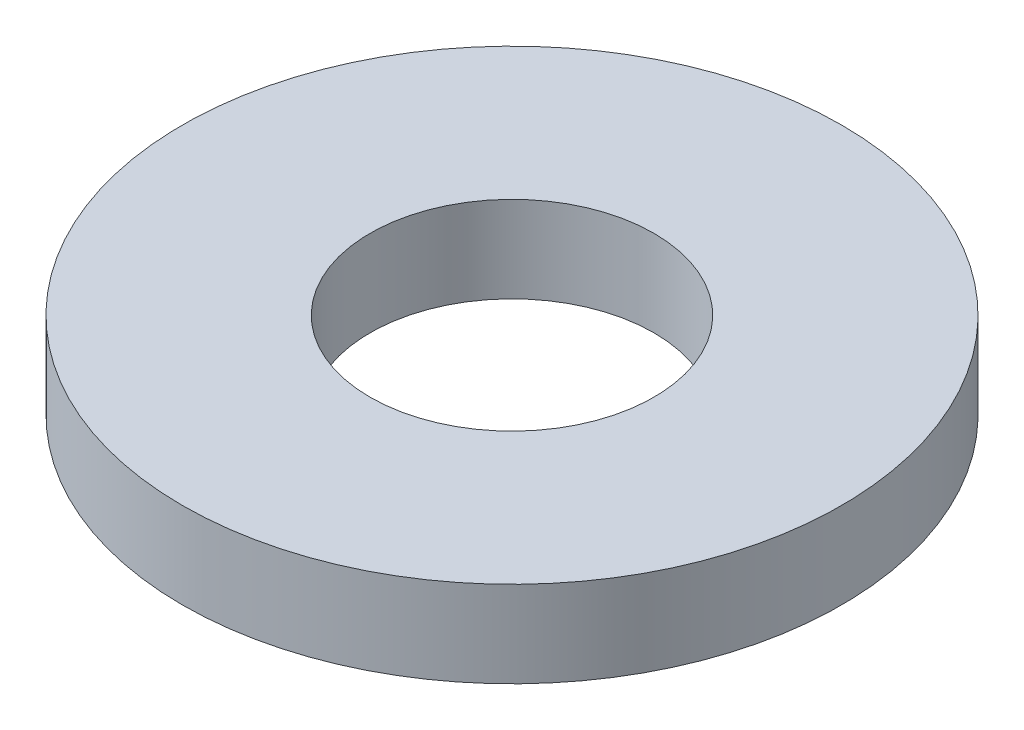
ISO-10303-21;
HEADER;
FILE_DESCRIPTION(('STEP AP214'),'2;1');
FILE_NAME('part.step','',(''),(''),'','','');
FILE_SCHEMA(('AUTOMOTIVE_DESIGN { 1 0 10303 214 1 1 1 1 }'));
ENDSEC;
DATA;
#1=APPLICATION_CONTEXT('core data for automotive mechanical design processes');
#2=APPLICATION_PROTOCOL_DEFINITION('international standard','automotive_design',2000,#1);
#3=PRODUCT_CONTEXT('',#1,'mechanical');
#4=PRODUCT('Part','Part','',(#3));
#5=PRODUCT_RELATED_PRODUCT_CATEGORY('part','',(#4));
#6=PRODUCT_DEFINITION_FORMATION('','',#4);
#7=PRODUCT_DEFINITION_CONTEXT('part definition',#1,'design');
#8=PRODUCT_DEFINITION('design','',#6,#7);
#9=PRODUCT_DEFINITION_SHAPE('','',#8);
#10=(LENGTH_UNIT() NAMED_UNIT(*) SI_UNIT(.MILLI.,.METRE.));
#11=(NAMED_UNIT(*) PLANE_ANGLE_UNIT() SI_UNIT($,.RADIAN.));
#12=(NAMED_UNIT(*) SI_UNIT($,.STERADIAN.) SOLID_ANGLE_UNIT());
#13=UNCERTAINTY_MEASURE_WITH_UNIT(LENGTH_MEASURE(1.E-05),#10,'distance_accuracy_value','');
#14=(GEOMETRIC_REPRESENTATION_CONTEXT(3) GLOBAL_UNCERTAINTY_ASSIGNED_CONTEXT((#13)) GLOBAL_UNIT_ASSIGNED_CONTEXT((#10,
#11,#12)) REPRESENTATION_CONTEXT('',''));
#15=CARTESIAN_POINT('',(0.,0.,0.));
#16=DIRECTION('',(0.,0.,1.));
#17=DIRECTION('',(1.,0.,0.));
#18=AXIS2_PLACEMENT_3D('',#15,#16,#17);
#19=CARTESIAN_POINT('',(0.,2.159,0.));
#20=DIRECTION('',(0.,1.,0.));
#21=DIRECTION('',(0.,0.,1.));
#22=AXIS2_PLACEMENT_3D('',#19,#20,#21);
#23=PLANE('',#22);
#24=CARTESIAN_POINT('',(0.,2.159,0.));
#25=DIRECTION('',(0.,1.,0.));
#26=DIRECTION('',(0.,0.,1.));
#27=AXIS2_PLACEMENT_3D('',#24,#25,#26);
#28=CIRCLE('',#27,8.255);
#29=CARTESIAN_POINT('',(0.,2.159,8.255));
#30=VERTEX_POINT('',#29);
#31=EDGE_CURVE('E10',#30,#30,#28,.T.);
#32=ORIENTED_EDGE('',*,*,#31,.T.);
#33=EDGE_LOOP('',(#32));
#34=FACE_BOUND('',#33,.T.);
#35=CARTESIAN_POINT('',(0.,2.159,0.));
#36=DIRECTION('',(0.,1.,0.));
#37=DIRECTION('',(0.,0.,1.));
#38=AXIS2_PLACEMENT_3D('',#35,#36,#37);
#39=CIRCLE('',#38,3.556);
#40=CARTESIAN_POINT('',(0.,2.159,3.556));
#41=VERTEX_POINT('',#40);
#42=EDGE_CURVE('E42',#41,#41,#39,.T.);
#43=ORIENTED_EDGE('',*,*,#42,.F.);
#44=EDGE_LOOP('',(#43));
#45=FACE_BOUND('',#44,.T.);
#46=ADVANCED_FACE('F31',(#34,#45),#23,.T.);
#47=CARTESIAN_POINT('',(0.,0.,0.));
#48=DIRECTION('',(0.,1.,0.));
#49=DIRECTION('',(0.,0.,1.));
#50=AXIS2_PLACEMENT_3D('',#47,#48,#49);
#51=PLANE('',#50);
#52=CARTESIAN_POINT('',(0.,0.,0.));
#53=DIRECTION('',(0.,1.,0.));
#54=DIRECTION('',(0.,0.,1.));
#55=AXIS2_PLACEMENT_3D('',#52,#53,#54);
#56=CIRCLE('',#55,8.255);
#57=CARTESIAN_POINT('',(0.,0.,8.255));
#58=VERTEX_POINT('',#57);
#59=EDGE_CURVE('E35',#58,#58,#56,.T.);
#60=ORIENTED_EDGE('',*,*,#59,.F.);
#61=EDGE_LOOP('',(#60));
#62=FACE_BOUND('',#61,.T.);
#63=CARTESIAN_POINT('',(0.,0.,0.));
#64=DIRECTION('',(0.,1.,0.));
#65=DIRECTION('',(0.,0.,1.));
#66=AXIS2_PLACEMENT_3D('',#63,#64,#65);
#67=CIRCLE('',#66,3.556);
#68=CARTESIAN_POINT('',(0.,0.,3.556));
#69=VERTEX_POINT('',#68);
#70=EDGE_CURVE('E44',#69,#69,#67,.T.);
#71=ORIENTED_EDGE('',*,*,#70,.T.);
#72=EDGE_LOOP('',(#71));
#73=FACE_BOUND('',#72,.T.);
#74=ADVANCED_FACE('F54',(#62,#73),#51,.F.);
#75=CARTESIAN_POINT('',(0.,2.159,0.));
#76=DIRECTION('',(0.,-1.,0.));
#77=DIRECTION('',(0.,0.,-1.));
#78=AXIS2_PLACEMENT_3D('',#75,#76,#77);
#79=CYLINDRICAL_SURFACE('',#78,8.255);
#80=ORIENTED_EDGE('',*,*,#31,.F.);
#81=EDGE_LOOP('',(#80));
#82=FACE_BOUND('',#81,.T.);
#83=ORIENTED_EDGE('',*,*,#59,.T.);
#84=EDGE_LOOP('',(#83));
#85=FACE_BOUND('',#84,.T.);
#86=ADVANCED_FACE('F33',(#82,#85),#79,.T.);
#87=CARTESIAN_POINT('',(0.,2.159,0.));
#88=DIRECTION('',(0.,-1.,0.));
#89=DIRECTION('',(0.,0.,-1.));
#90=AXIS2_PLACEMENT_3D('',#87,#88,#89);
#91=CYLINDRICAL_SURFACE('',#90,3.556);
#92=ORIENTED_EDGE('',*,*,#42,.T.);
#93=EDGE_LOOP('',(#92));
#94=FACE_BOUND('',#93,.T.);
#95=ORIENTED_EDGE('',*,*,#70,.F.);
#96=EDGE_LOOP('',(#95));
#97=FACE_BOUND('',#96,.T.);
#98=ADVANCED_FACE('F50',(#94,#97),#91,.F.);
#99=CLOSED_SHELL('',(#46,#74,#86,#98));
#100=MANIFOLD_SOLID_BREP('B2',#99);
#101=ADVANCED_BREP_SHAPE_REPRESENTATION('',(#18,#100),#14);
#102=SHAPE_DEFINITION_REPRESENTATION(#9,#101);
ENDSEC;
END-ISO-10303-21;
